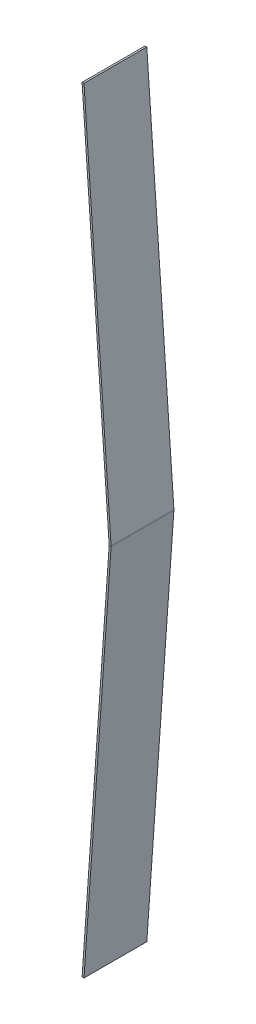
ISO-10303-21;
HEADER;
FILE_DESCRIPTION(('STEP AP214'),'2;1');
FILE_NAME('part.step','',(''),(''),'','','');
FILE_SCHEMA(('AUTOMOTIVE_DESIGN { 1 0 10303 214 1 1 1 1 }'));
ENDSEC;
DATA;
#1=APPLICATION_CONTEXT('core data for automotive mechanical design processes');
#2=APPLICATION_PROTOCOL_DEFINITION('international standard','automotive_design',2000,#1);
#3=PRODUCT_CONTEXT('',#1,'mechanical');
#4=PRODUCT('Part','Part','',(#3));
#5=PRODUCT_RELATED_PRODUCT_CATEGORY('part','',(#4));
#6=PRODUCT_DEFINITION_FORMATION('','',#4);
#7=PRODUCT_DEFINITION_CONTEXT('part definition',#1,'design');
#8=PRODUCT_DEFINITION('design','',#6,#7);
#9=PRODUCT_DEFINITION_SHAPE('','',#8);
#10=(LENGTH_UNIT() NAMED_UNIT(*) SI_UNIT(.MILLI.,.METRE.));
#11=(NAMED_UNIT(*) PLANE_ANGLE_UNIT() SI_UNIT($,.RADIAN.));
#12=(NAMED_UNIT(*) SI_UNIT($,.STERADIAN.) SOLID_ANGLE_UNIT());
#13=UNCERTAINTY_MEASURE_WITH_UNIT(LENGTH_MEASURE(1.E-05),#10,'distance_accuracy_value','');
#14=(GEOMETRIC_REPRESENTATION_CONTEXT(3) GLOBAL_UNCERTAINTY_ASSIGNED_CONTEXT((#13)) GLOBAL_UNIT_ASSIGNED_CONTEXT((#10,
#11,#12)) REPRESENTATION_CONTEXT('',''));
#15=CARTESIAN_POINT('',(0.,0.,0.));
#16=DIRECTION('',(0.,0.,1.));
#17=DIRECTION('',(1.,0.,0.));
#18=AXIS2_PLACEMENT_3D('',#15,#16,#17);
#19=CARTESIAN_POINT('',(-0.0619486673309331,-0.885907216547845,209.55));
#20=DIRECTION('',(0.,0.,1.));
#21=DIRECTION('',(1.,0.,0.));
#22=AXIS2_PLACEMENT_3D('',#19,#20,#21);
#23=PLANE('',#22);
#24=DIRECTION('',(-0.997564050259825,0.0697564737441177,0.));
#25=VECTOR('',#24,1.);
#26=CARTESIAN_POINT('',(-0.0619486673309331,-0.885907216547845,209.55));
#27=LINE('',#26,#25);
#28=CARTESIAN_POINT('',(-0.0619486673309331,-0.885907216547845,209.55));
#29=VERTEX_POINT('',#28);
#30=CARTESIAN_POINT('',(-6.39648038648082,-0.442953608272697,209.55));
#31=VERTEX_POINT('',#30);
#32=EDGE_CURVE('E11',#29,#31,#27,.T.);
#33=ORIENTED_EDGE('',*,*,#32,.F.);
#34=CARTESIAN_POINT('',(-12.7310121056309,2.46281944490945E-12,209.55));
#35=DIRECTION('',(0.,0.,1.));
#36=DIRECTION('',(1.,0.,0.));
#37=AXIS2_PLACEMENT_3D('',#34,#35,#36);
#38=CIRCLE('',#37,12.7);
#39=CARTESIAN_POINT('',(-0.0619486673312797,0.885907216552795,209.55));
#40=VERTEX_POINT('',#39);
#41=EDGE_CURVE('E135',#40,#29,#38,.F.);
#42=ORIENTED_EDGE('',*,*,#41,.F.);
#43=DIRECTION('',(0.997564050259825,0.0697564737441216,0.));
#44=VECTOR('',#43,1.);
#45=CARTESIAN_POINT('',(-6.396480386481,0.442953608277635,209.55));
#46=LINE('',#45,#44);
#47=CARTESIAN_POINT('',(-6.396480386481,0.442953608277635,209.55));
#48=VERTEX_POINT('',#47);
#49=EDGE_CURVE('E46',#48,#40,#46,.T.);
#50=ORIENTED_EDGE('',*,*,#49,.F.);
#51=CARTESIAN_POINT('',(-12.7310121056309,2.46281944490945E-12,209.55));
#52=DIRECTION('',(0.,0.,1.));
#53=DIRECTION('',(1.,0.,0.));
#54=AXIS2_PLACEMENT_3D('',#51,#52,#53);
#55=CIRCLE('',#54,6.35);
#56=EDGE_CURVE('E128',#48,#31,#55,.F.);
#57=ORIENTED_EDGE('',*,*,#56,.T.);
#58=EDGE_LOOP('',(#33,#42,#50,#57));
#59=FACE_BOUND('',#58,.T.);
#60=ADVANCED_FACE('F38',(#59),#23,.T.);
#61=CARTESIAN_POINT('',(-6.396480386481,0.442953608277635,209.55));
#62=DIRECTION('',(0.,0.,1.));
#63=DIRECTION('',(1.,0.,0.));
#64=AXIS2_PLACEMENT_3D('',#61,#62,#63);
#65=PLANE('',#64);
#66=DIRECTION('',(-0.0697564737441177,-0.997564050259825,0.));
#67=VECTOR('',#66,1.);
#68=CARTESIAN_POINT('',(0.,0.,209.55));
#69=LINE('',#68,#67);
#70=CARTESIAN_POINT('',(-90.3611745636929,-1292.225,209.55));
#71=VERTEX_POINT('',#70);
#72=EDGE_CURVE('E184',#29,#71,#69,.T.);
#73=ORIENTED_EDGE('',*,*,#72,.F.);
#74=ORIENTED_EDGE('',*,*,#32,.T.);
#75=DIRECTION('',(-0.0697564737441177,-0.997564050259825,0.));
#76=VECTOR('',#75,1.);
#77=CARTESIAN_POINT('',(-6.33453171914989,0.442953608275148,209.55));
#78=LINE('',#77,#76);
#79=CARTESIAN_POINT('',(-96.6957062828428,-1291.78204639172,209.55));
#80=VERTEX_POINT('',#79);
#81=EDGE_CURVE('E94',#31,#80,#78,.T.);
#82=ORIENTED_EDGE('',*,*,#81,.T.);
#83=DIRECTION('',(-0.997564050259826,0.0697564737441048,0.));
#84=VECTOR('',#83,1.);
#85=CARTESIAN_POINT('',(-90.3611745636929,-1292.225,209.55));
#86=LINE('',#85,#84);
#87=EDGE_CURVE('E341',#71,#80,#86,.T.);
#88=ORIENTED_EDGE('',*,*,#87,.F.);
#89=EDGE_LOOP('',(#73,#74,#82,#88));
#90=FACE_BOUND('',#89,.T.);
#91=ADVANCED_FACE('F192',(#90),#65,.T.);
#92=CARTESIAN_POINT('',(-0.0619486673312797,0.885907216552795,0.));
#93=DIRECTION('',(0.,0.,-1.));
#94=DIRECTION('',(-1.,0.,0.));
#95=AXIS2_PLACEMENT_3D('',#92,#93,#94);
#96=PLANE('',#95);
#97=DIRECTION('',(-0.997564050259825,-0.0697564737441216,0.));
#98=VECTOR('',#97,1.);
#99=CARTESIAN_POINT('',(-0.0619486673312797,0.885907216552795,0.));
#100=LINE('',#99,#98);
#101=CARTESIAN_POINT('',(-0.0619486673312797,0.885907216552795,0.));
#102=VERTEX_POINT('',#101);
#103=CARTESIAN_POINT('',(-6.396480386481,0.442953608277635,0.));
#104=VERTEX_POINT('',#103);
#105=EDGE_CURVE('E81',#102,#104,#100,.T.);
#106=ORIENTED_EDGE('',*,*,#105,.F.);
#107=CARTESIAN_POINT('',(-12.7310121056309,2.46281944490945E-12,0.));
#108=DIRECTION('',(0.,0.,1.));
#109=DIRECTION('',(1.,0.,0.));
#110=AXIS2_PLACEMENT_3D('',#107,#108,#109);
#111=CIRCLE('',#110,12.7);
#112=CARTESIAN_POINT('',(-0.0619486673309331,-0.885907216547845,0.));
#113=VERTEX_POINT('',#112);
#114=EDGE_CURVE('E150',#102,#113,#111,.F.);
#115=ORIENTED_EDGE('',*,*,#114,.T.);
#116=DIRECTION('',(0.997564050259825,-0.0697564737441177,0.));
#117=VECTOR('',#116,1.);
#118=CARTESIAN_POINT('',(-6.39648038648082,-0.442953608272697,0.));
#119=LINE('',#118,#117);
#120=CARTESIAN_POINT('',(-6.39648038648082,-0.442953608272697,0.));
#121=VERTEX_POINT('',#120);
#122=EDGE_CURVE('E88',#121,#113,#119,.T.);
#123=ORIENTED_EDGE('',*,*,#122,.F.);
#124=CARTESIAN_POINT('',(-12.7310121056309,2.46281944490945E-12,0.));
#125=DIRECTION('',(0.,0.,1.));
#126=DIRECTION('',(1.,0.,0.));
#127=AXIS2_PLACEMENT_3D('',#124,#125,#126);
#128=CIRCLE('',#127,6.35);
#129=EDGE_CURVE('E157',#104,#121,#128,.F.);
#130=ORIENTED_EDGE('',*,*,#129,.F.);
#131=EDGE_LOOP('',(#106,#115,#123,#130));
#132=FACE_BOUND('',#131,.T.);
#133=ADVANCED_FACE('F190',(#132),#96,.T.);
#134=CARTESIAN_POINT('',(-6.39648038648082,-0.442953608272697,0.));
#135=DIRECTION('',(0.,0.,-1.));
#136=DIRECTION('',(-1.,0.,0.));
#137=AXIS2_PLACEMENT_3D('',#134,#135,#136);
#138=PLANE('',#137);
#139=DIRECTION('',(0.0697564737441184,-0.997564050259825,0.));
#140=VECTOR('',#139,1.);
#141=CARTESIAN_POINT('',(-90.3611745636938,1292.225,0.));
#142=LINE('',#141,#140);
#143=CARTESIAN_POINT('',(-90.3611745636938,1292.225,0.));
#144=VERTEX_POINT('',#143);
#145=EDGE_CURVE('E152',#144,#102,#142,.T.);
#146=ORIENTED_EDGE('',*,*,#145,.T.);
#147=ORIENTED_EDGE('',*,*,#105,.T.);
#148=DIRECTION('',(0.0697564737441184,-0.997564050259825,0.));
#149=VECTOR('',#148,1.);
#150=CARTESIAN_POINT('',(-96.6957062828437,1291.78204639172,0.));
#151=LINE('',#150,#149);
#152=CARTESIAN_POINT('',(-96.6957062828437,1291.78204639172,0.));
#153=VERTEX_POINT('',#152);
#154=EDGE_CURVE('E155',#153,#104,#151,.T.);
#155=ORIENTED_EDGE('',*,*,#154,.F.);
#156=DIRECTION('',(0.997564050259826,0.0697564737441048,0.));
#157=VECTOR('',#156,1.);
#158=CARTESIAN_POINT('',(-96.6957062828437,1291.78204639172,0.));
#159=LINE('',#158,#157);
#160=EDGE_CURVE('E116',#153,#144,#159,.T.);
#161=ORIENTED_EDGE('',*,*,#160,.T.);
#162=EDGE_LOOP('',(#146,#147,#155,#161));
#163=FACE_BOUND('',#162,.T.);
#164=ADVANCED_FACE('F186',(#163),#138,.T.);
#165=CARTESIAN_POINT('',(-6.33453171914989,0.442953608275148,209.55));
#166=DIRECTION('',(0.997564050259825,-0.0697564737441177,0.));
#167=DIRECTION('',(0.0697564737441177,0.997564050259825,0.));
#168=AXIS2_PLACEMENT_3D('',#165,#166,#167);
#169=PLANE('',#168);
#170=DIRECTION('',(-0.0697564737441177,-0.997564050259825,0.));
#171=VECTOR('',#170,1.);
#172=CARTESIAN_POINT('',(-6.33453171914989,0.442953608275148,0.));
#173=LINE('',#172,#171);
#174=CARTESIAN_POINT('',(-96.6957062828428,-1291.78204639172,0.));
#175=VERTEX_POINT('',#174);
#176=EDGE_CURVE('E141',#121,#175,#173,.T.);
#177=ORIENTED_EDGE('',*,*,#176,.T.);
#178=DIRECTION('',(0.,0.,-1.));
#179=VECTOR('',#178,1.);
#180=CARTESIAN_POINT('',(-96.6957062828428,-1291.78204639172,209.55));
#181=LINE('',#180,#179);
#182=EDGE_CURVE('E171',#80,#175,#181,.T.);
#183=ORIENTED_EDGE('',*,*,#182,.F.);
#184=ORIENTED_EDGE('',*,*,#81,.F.);
#185=DIRECTION('',(0.,0.,-1.));
#186=VECTOR('',#185,1.);
#187=CARTESIAN_POINT('',(-6.39648038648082,-0.442953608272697,209.55));
#188=LINE('',#187,#186);
#189=EDGE_CURVE('E140',#31,#121,#188,.T.);
#190=ORIENTED_EDGE('',*,*,#189,.T.);
#191=EDGE_LOOP('',(#177,#183,#184,#190));
#192=FACE_BOUND('',#191,.T.);
#193=ADVANCED_FACE('F198',(#192),#169,.F.);
#194=CARTESIAN_POINT('',(-90.3611745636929,-1292.225,209.55));
#195=DIRECTION('',(-0.0697564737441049,-0.997564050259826,0.));
#196=DIRECTION('',(0.997564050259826,-0.0697564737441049,0.));
#197=AXIS2_PLACEMENT_3D('',#194,#195,#196);
#198=PLANE('',#197);
#199=DIRECTION('',(-0.997564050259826,0.0697564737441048,0.));
#200=VECTOR('',#199,1.);
#201=CARTESIAN_POINT('',(-90.3611745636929,-1292.225,0.));
#202=LINE('',#201,#200);
#203=CARTESIAN_POINT('',(-90.3611745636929,-1292.225,0.));
#204=VERTEX_POINT('',#203);
#205=EDGE_CURVE('E144',#204,#175,#202,.T.);
#206=ORIENTED_EDGE('',*,*,#205,.F.);
#207=DIRECTION('',(0.,0.,-1.));
#208=VECTOR('',#207,1.);
#209=CARTESIAN_POINT('',(-90.3611745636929,-1292.225,209.55));
#210=LINE('',#209,#208);
#211=EDGE_CURVE('E169',#71,#204,#210,.T.);
#212=ORIENTED_EDGE('',*,*,#211,.F.);
#213=ORIENTED_EDGE('',*,*,#87,.T.);
#214=ORIENTED_EDGE('',*,*,#182,.T.);
#215=EDGE_LOOP('',(#206,#212,#213,#214));
#216=FACE_BOUND('',#215,.T.);
#217=ADVANCED_FACE('F229',(#216),#198,.T.);
#218=CARTESIAN_POINT('',(0.,0.,209.55));
#219=DIRECTION('',(0.997564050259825,-0.0697564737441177,0.));
#220=DIRECTION('',(0.0697564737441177,0.997564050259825,0.));
#221=AXIS2_PLACEMENT_3D('',#218,#219,#220);
#222=PLANE('',#221);
#223=DIRECTION('',(-0.0697564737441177,-0.997564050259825,0.));
#224=VECTOR('',#223,1.);
#225=CARTESIAN_POINT('',(0.,0.,0.));
#226=LINE('',#225,#224);
#227=EDGE_CURVE('E147',#113,#204,#226,.T.);
#228=ORIENTED_EDGE('',*,*,#227,.F.);
#229=DIRECTION('',(0.,0.,-1.));
#230=VECTOR('',#229,1.);
#231=CARTESIAN_POINT('',(-0.0619486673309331,-0.885907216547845,209.55));
#232=LINE('',#231,#230);
#233=EDGE_CURVE('E166',#29,#113,#232,.T.);
#234=ORIENTED_EDGE('',*,*,#233,.F.);
#235=ORIENTED_EDGE('',*,*,#72,.T.);
#236=ORIENTED_EDGE('',*,*,#211,.T.);
#237=EDGE_LOOP('',(#228,#234,#235,#236));
#238=FACE_BOUND('',#237,.T.);
#239=ADVANCED_FACE('F240',(#238),#222,.T.);
#240=CARTESIAN_POINT('',(-12.7310121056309,2.46281944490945E-12,209.55));
#241=DIRECTION('',(0.,0.,-1.));
#242=DIRECTION('',(-1.,0.,0.));
#243=AXIS2_PLACEMENT_3D('',#240,#241,#242);
#244=CYLINDRICAL_SURFACE('',#243,12.7);
#245=ORIENTED_EDGE('',*,*,#114,.F.);
#246=DIRECTION('',(0.,0.,-1.));
#247=VECTOR('',#246,1.);
#248=CARTESIAN_POINT('',(-0.0619486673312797,0.885907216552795,209.55));
#249=LINE('',#248,#247);
#250=EDGE_CURVE('E163',#40,#102,#249,.T.);
#251=ORIENTED_EDGE('',*,*,#250,.F.);
#252=ORIENTED_EDGE('',*,*,#41,.T.);
#253=ORIENTED_EDGE('',*,*,#233,.T.);
#254=EDGE_LOOP('',(#245,#251,#252,#253));
#255=FACE_BOUND('',#254,.T.);
#256=ADVANCED_FACE('F180',(#255),#244,.T.);
#257=CARTESIAN_POINT('',(-90.3611745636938,1292.225,209.55));
#258=DIRECTION('',(0.997564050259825,0.0697564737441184,0.));
#259=DIRECTION('',(-0.0697564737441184,0.997564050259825,0.));
#260=AXIS2_PLACEMENT_3D('',#257,#258,#259);
#261=PLANE('',#260);
#262=ORIENTED_EDGE('',*,*,#145,.F.);
#263=DIRECTION('',(0.,0.,-1.));
#264=VECTOR('',#263,1.);
#265=CARTESIAN_POINT('',(-90.3611745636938,1292.225,209.55));
#266=LINE('',#265,#264);
#267=CARTESIAN_POINT('',(-90.3611745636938,1292.225,209.55));
#268=VERTEX_POINT('',#267);
#269=EDGE_CURVE('E118',#268,#144,#266,.T.);
#270=ORIENTED_EDGE('',*,*,#269,.F.);
#271=DIRECTION('',(0.0697564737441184,-0.997564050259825,0.));
#272=VECTOR('',#271,1.);
#273=CARTESIAN_POINT('',(-90.3611745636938,1292.225,209.55));
#274=LINE('',#273,#272);
#275=EDGE_CURVE('E133',#268,#40,#274,.T.);
#276=ORIENTED_EDGE('',*,*,#275,.T.);
#277=ORIENTED_EDGE('',*,*,#250,.T.);
#278=EDGE_LOOP('',(#262,#270,#276,#277));
#279=FACE_BOUND('',#278,.T.);
#280=ADVANCED_FACE('F185',(#279),#261,.T.);
#281=CARTESIAN_POINT('',(-96.6957062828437,1291.78204639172,209.55));
#282=DIRECTION('',(-0.0697564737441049,0.997564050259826,0.));
#283=DIRECTION('',(-0.997564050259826,-0.0697564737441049,0.));
#284=AXIS2_PLACEMENT_3D('',#281,#282,#283);
#285=PLANE('',#284);
#286=ORIENTED_EDGE('',*,*,#160,.F.);
#287=DIRECTION('',(0.,0.,-1.));
#288=VECTOR('',#287,1.);
#289=CARTESIAN_POINT('',(-96.6957062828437,1291.78204639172,209.55));
#290=LINE('',#289,#288);
#291=CARTESIAN_POINT('',(-96.6957062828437,1291.78204639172,209.55));
#292=VERTEX_POINT('',#291);
#293=EDGE_CURVE('E110',#292,#153,#290,.T.);
#294=ORIENTED_EDGE('',*,*,#293,.F.);
#295=DIRECTION('',(0.997564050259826,0.0697564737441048,0.));
#296=VECTOR('',#295,1.);
#297=CARTESIAN_POINT('',(-96.6957062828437,1291.78204639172,209.55));
#298=LINE('',#297,#296);
#299=EDGE_CURVE('E114',#292,#268,#298,.T.);
#300=ORIENTED_EDGE('',*,*,#299,.T.);
#301=ORIENTED_EDGE('',*,*,#269,.T.);
#302=EDGE_LOOP('',(#286,#294,#300,#301));
#303=FACE_BOUND('',#302,.T.);
#304=ADVANCED_FACE('F112',(#303),#285,.T.);
#305=CARTESIAN_POINT('',(-96.6957062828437,1291.78204639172,209.55));
#306=DIRECTION('',(0.997564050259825,0.0697564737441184,0.));
#307=DIRECTION('',(-0.0697564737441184,0.997564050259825,0.));
#308=AXIS2_PLACEMENT_3D('',#305,#306,#307);
#309=PLANE('',#308);
#310=ORIENTED_EDGE('',*,*,#154,.T.);
#311=DIRECTION('',(0.,0.,-1.));
#312=VECTOR('',#311,1.);
#313=CARTESIAN_POINT('',(-6.396480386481,0.442953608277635,209.55));
#314=LINE('',#313,#312);
#315=EDGE_CURVE('E119',#48,#104,#314,.T.);
#316=ORIENTED_EDGE('',*,*,#315,.F.);
#317=DIRECTION('',(0.0697564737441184,-0.997564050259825,0.));
#318=VECTOR('',#317,1.);
#319=CARTESIAN_POINT('',(-96.6957062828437,1291.78204639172,209.55));
#320=LINE('',#319,#318);
#321=EDGE_CURVE('E123',#292,#48,#320,.T.);
#322=ORIENTED_EDGE('',*,*,#321,.F.);
#323=ORIENTED_EDGE('',*,*,#293,.T.);
#324=EDGE_LOOP('',(#310,#316,#322,#323));
#325=FACE_BOUND('',#324,.T.);
#326=ADVANCED_FACE('F124',(#325),#309,.F.);
#327=CARTESIAN_POINT('',(-12.7310121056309,2.46281944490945E-12,209.55));
#328=DIRECTION('',(0.,0.,-1.));
#329=DIRECTION('',(-1.,0.,0.));
#330=AXIS2_PLACEMENT_3D('',#327,#328,#329);
#331=CYLINDRICAL_SURFACE('',#330,6.35);
#332=ORIENTED_EDGE('',*,*,#129,.T.);
#333=ORIENTED_EDGE('',*,*,#189,.F.);
#334=ORIENTED_EDGE('',*,*,#56,.F.);
#335=ORIENTED_EDGE('',*,*,#315,.T.);
#336=EDGE_LOOP('',(#332,#333,#334,#335));
#337=FACE_BOUND('',#336,.T.);
#338=ADVANCED_FACE('F188',(#337),#331,.F.);
#339=CARTESIAN_POINT('',(-12.7310121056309,2.46281944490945E-12,209.55));
#340=DIRECTION('',(0.,0.,1.));
#341=DIRECTION('',(1.,0.,0.));
#342=AXIS2_PLACEMENT_3D('',#339,#340,#341);
#343=PLANE('',#342);
#344=ORIENTED_EDGE('',*,*,#321,.T.);
#345=ORIENTED_EDGE('',*,*,#49,.T.);
#346=ORIENTED_EDGE('',*,*,#275,.F.);
#347=ORIENTED_EDGE('',*,*,#299,.F.);
#348=EDGE_LOOP('',(#344,#345,#346,#347));
#349=FACE_BOUND('',#348,.T.);
#350=ADVANCED_FACE('F131',(#349),#343,.T.);
#351=CARTESIAN_POINT('',(-12.7310121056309,2.46281944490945E-12,0.));
#352=DIRECTION('',(0.,0.,1.));
#353=DIRECTION('',(1.,0.,0.));
#354=AXIS2_PLACEMENT_3D('',#351,#352,#353);
#355=PLANE('',#354);
#356=ORIENTED_EDGE('',*,*,#176,.F.);
#357=ORIENTED_EDGE('',*,*,#122,.T.);
#358=ORIENTED_EDGE('',*,*,#227,.T.);
#359=ORIENTED_EDGE('',*,*,#205,.T.);
#360=EDGE_LOOP('',(#356,#357,#358,#359));
#361=FACE_BOUND('',#360,.T.);
#362=ADVANCED_FACE('F306',(#361),#355,.F.);
#363=CLOSED_SHELL('',(#60,#91,#133,#164,#193,#217,#239,#256,#280,#304,#326,#338,#350,#362));
#364=MANIFOLD_SOLID_BREP('B2',#363);
#365=ADVANCED_BREP_SHAPE_REPRESENTATION('',(#18,#364),#14);
#366=SHAPE_DEFINITION_REPRESENTATION(#9,#365);
ENDSEC;
END-ISO-10303-21;
